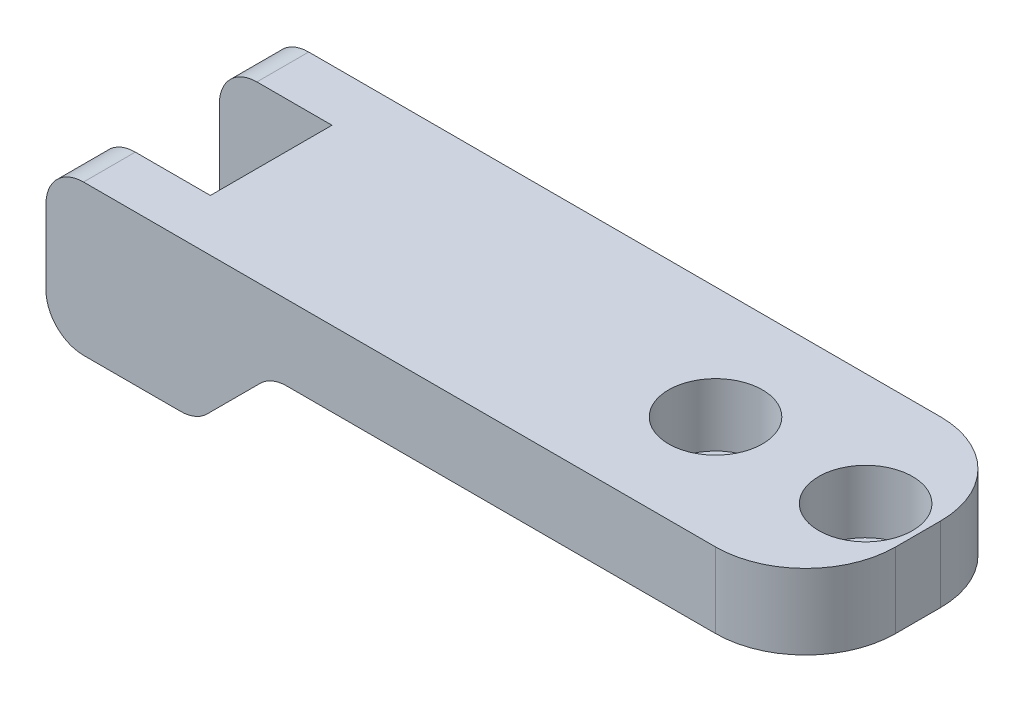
from build123d import *

# Parameters (mm, degrees)
BOSS_EXTRUDE1_DEPTH                            = 9.525
SKETCH2_W                                      = 9.525
SKETCH2_H                                      = 10.287
CUT_EXTRUDE1_DEPTH                             = 48.91806099
CBORE_FOR_8_SOCKET_HEAD_CAP_SCREW1_D           = 4.9149
CBORE_FOR_8_SOCKET_HEAD_CAP_SCREW1_CBORE_D     = 7.9375
CBORE_FOR_8_SOCKET_HEAD_CAP_SCREW1_CBORE_DEPTH = 5.3086
FILLET1_R                                      = 7.62
FILLET2_R                                      = 3.175


with BuildPart() as part:
    # Sketch1 → Boss-Extrude1 (new, symmetric)
    with BuildSketch(Plane.XY):
        Polygon((0, 0), (45.212, 0), (45.212, 6.35), (-19.05, 6.35), (-19.05, -6.35), (-6.35, -6.35), align=None)
    extrude(amount=BOSS_EXTRUDE1_DEPTH, both=True)

    # Sketch2 → Cut-Extrude1 (cut, through all)
    with BuildSketch(Plane(origin=(0, 6.35, 0), x_dir=(1, 0, 0), z_dir=(0, 1, 0))):
        with Locations((-14.2875, 0)):
            Rectangle(SKETCH2_W, SKETCH2_H)
    extrude(amount=-CUT_EXTRUDE1_DEPTH, mode=Mode.SUBTRACT)

    # CBORE for _8 Socket Head Cap Screw1 (through all)
    with Locations(Plane(origin=(0, 6.35, 0), x_dir=(1, 0, 0), z_dir=(0, 1, 0))):
        with Locations((40.767, 0), (28.067, 0)):
            CounterBoreHole(CBORE_FOR_8_SOCKET_HEAD_CAP_SCREW1_D / 2, CBORE_FOR_8_SOCKET_HEAD_CAP_SCREW1_CBORE_D / 2, CBORE_FOR_8_SOCKET_HEAD_CAP_SCREW1_CBORE_DEPTH)

    # Fillet1
    fillet1_edges = [part.edges().sort_by_distance(p)[0] for p in [
        (45.212, 3.175, 9.525),
        (45.212, 3.175, -9.525),
    ]]
    fillet(fillet1_edges, radius=FILLET1_R)

    # Fillet2
    fillet2_edges = [part.edges().sort_by_distance(p)[0] for p in [
        (-6.35, -6.35, 0),
        (-19.05, -6.35, 7.33425),
        (-19.05, 6.35, 7.33425),
        (0, 0, 0),
        (-19.05, -6.35, -7.33425),
        (-19.05, 6.35, -7.33425),
    ]]
    fillet(fillet2_edges, radius=FILLET2_R)


solid = part.part
